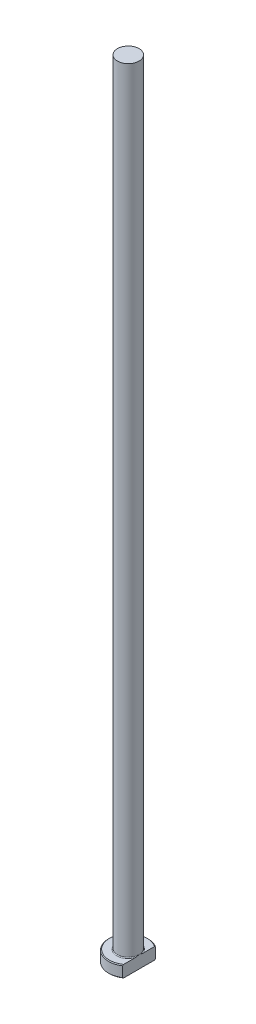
ISO-10303-21;
HEADER;
FILE_DESCRIPTION(('STEP AP214'),'2;1');
FILE_NAME('part.step','',(''),(''),'','','');
FILE_SCHEMA(('AUTOMOTIVE_DESIGN { 1 0 10303 214 1 1 1 1 }'));
ENDSEC;
DATA;
#1=APPLICATION_CONTEXT('core data for automotive mechanical design processes');
#2=APPLICATION_PROTOCOL_DEFINITION('international standard','automotive_design',2000,#1);
#3=PRODUCT_CONTEXT('',#1,'mechanical');
#4=PRODUCT('Part','Part','',(#3));
#5=PRODUCT_RELATED_PRODUCT_CATEGORY('part','',(#4));
#6=PRODUCT_DEFINITION_FORMATION('','',#4);
#7=PRODUCT_DEFINITION_CONTEXT('part definition',#1,'design');
#8=PRODUCT_DEFINITION('design','',#6,#7);
#9=PRODUCT_DEFINITION_SHAPE('','',#8);
#10=(LENGTH_UNIT() NAMED_UNIT(*) SI_UNIT(.MILLI.,.METRE.));
#11=(NAMED_UNIT(*) PLANE_ANGLE_UNIT() SI_UNIT($,.RADIAN.));
#12=(NAMED_UNIT(*) SI_UNIT($,.STERADIAN.) SOLID_ANGLE_UNIT());
#13=UNCERTAINTY_MEASURE_WITH_UNIT(LENGTH_MEASURE(1.E-05),#10,'distance_accuracy_value','');
#14=(GEOMETRIC_REPRESENTATION_CONTEXT(3) GLOBAL_UNCERTAINTY_ASSIGNED_CONTEXT((#13)) GLOBAL_UNIT_ASSIGNED_CONTEXT((#10,
#11,#12)) REPRESENTATION_CONTEXT('',''));
#15=CARTESIAN_POINT('',(0.,0.,0.));
#16=DIRECTION('',(0.,0.,1.));
#17=DIRECTION('',(1.,0.,0.));
#18=AXIS2_PLACEMENT_3D('',#15,#16,#17);
#19=CARTESIAN_POINT('',(0.,0.,0.));
#20=DIRECTION('',(0.,-1.,0.));
#21=DIRECTION('',(0.,0.,-1.));
#22=AXIS2_PLACEMENT_3D('',#19,#20,#21);
#23=PLANE('',#22);
#24=CARTESIAN_POINT('',(0.,0.,0.));
#25=DIRECTION('',(0.,-1.,0.));
#26=DIRECTION('',(0.,0.,-1.));
#27=AXIS2_PLACEMENT_3D('',#24,#25,#26);
#28=CIRCLE('',#27,4.79999999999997);
#29=CARTESIAN_POINT('',(2.74999999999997,0.,3.93414539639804));
#30=VERTEX_POINT('',#29);
#31=CARTESIAN_POINT('',(2.74999999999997,0.,-3.93414539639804));
#32=VERTEX_POINT('',#31);
#33=EDGE_CURVE('E98',#30,#32,#28,.T.);
#34=ORIENTED_EDGE('',*,*,#33,.T.);
#35=DIRECTION('',(0.,0.,1.));
#36=VECTOR('',#35,1.);
#37=CARTESIAN_POINT('',(2.74999999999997,0.,-4.1758232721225));
#38=LINE('',#37,#36);
#39=EDGE_CURVE('E83',#32,#30,#38,.T.);
#40=ORIENTED_EDGE('',*,*,#39,.T.);
#41=EDGE_LOOP('',(#34,#40));
#42=FACE_BOUND('',#41,.T.);
#43=ADVANCED_FACE('F32',(#42),#23,.T.);
#44=CARTESIAN_POINT('',(0.,259.958771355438,0.));
#45=DIRECTION('',(0.,1.,0.));
#46=DIRECTION('',(0.,0.,1.));
#47=AXIS2_PLACEMENT_3D('',#44,#45,#46);
#48=CYLINDRICAL_SURFACE('',#47,4.99999999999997);
#49=CARTESIAN_POINT('',(0.,2.79999999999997,0.));
#50=DIRECTION('',(0.,1.,0.));
#51=DIRECTION('',(0.,0.,1.));
#52=AXIS2_PLACEMENT_3D('',#49,#50,#51);
#53=CIRCLE('',#52,4.99999999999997);
#54=CARTESIAN_POINT('',(2.74999999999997,2.79999999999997,4.1758232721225));
#55=VERTEX_POINT('',#54);
#56=CARTESIAN_POINT('',(2.74999999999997,2.79999999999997,-4.1758232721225));
#57=VERTEX_POINT('',#56);
#58=EDGE_CURVE('E104',#55,#57,#53,.F.);
#59=ORIENTED_EDGE('',*,*,#58,.T.);
#60=DIRECTION('',(0.,-1.,0.));
#61=VECTOR('',#60,1.);
#62=CARTESIAN_POINT('',(2.74999999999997,200.,-4.1758232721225));
#63=LINE('',#62,#61);
#64=CARTESIAN_POINT('',(2.74999999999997,0.200000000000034,-4.1758232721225));
#65=VERTEX_POINT('',#64);
#66=EDGE_CURVE('E183',#57,#65,#63,.T.);
#67=ORIENTED_EDGE('',*,*,#66,.T.);
#68=CARTESIAN_POINT('',(0.,0.200000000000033,0.));
#69=DIRECTION('',(0.,-1.,0.));
#70=DIRECTION('',(0.,0.,-1.));
#71=AXIS2_PLACEMENT_3D('',#68,#69,#70);
#72=CIRCLE('',#71,4.99999999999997);
#73=CARTESIAN_POINT('',(2.74999999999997,0.200000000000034,4.1758232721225));
#74=VERTEX_POINT('',#73);
#75=EDGE_CURVE('E100',#65,#74,#72,.F.);
#76=ORIENTED_EDGE('',*,*,#75,.T.);
#77=DIRECTION('',(0.,-1.,0.));
#78=VECTOR('',#77,1.);
#79=CARTESIAN_POINT('',(2.74999999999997,200.,4.1758232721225));
#80=LINE('',#79,#78);
#81=EDGE_CURVE('E93',#55,#74,#80,.T.);
#82=ORIENTED_EDGE('',*,*,#81,.F.);
#83=EDGE_LOOP('',(#59,#67,#76,#82));
#84=FACE_BOUND('',#83,.T.);
#85=ADVANCED_FACE('F158',(#84),#48,.T.);
#86=CARTESIAN_POINT('',(-4.99999999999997,3.,0.));
#87=DIRECTION('',(0.,1.,0.));
#88=DIRECTION('',(0.,0.,1.));
#89=AXIS2_PLACEMENT_3D('',#86,#87,#88);
#90=PLANE('',#89);
#91=CARTESIAN_POINT('',(0.,3.,0.));
#92=DIRECTION('',(0.,1.,0.));
#93=DIRECTION('',(0.,0.,1.));
#94=AXIS2_PLACEMENT_3D('',#91,#92,#93);
#95=CIRCLE('',#94,4.79999999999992);
#96=CARTESIAN_POINT('',(2.74999999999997,3.,-3.93414539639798));
#97=VERTEX_POINT('',#96);
#98=CARTESIAN_POINT('',(2.74999999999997,3.,3.93414539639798));
#99=VERTEX_POINT('',#98);
#100=EDGE_CURVE('E178',#97,#99,#95,.T.);
#101=ORIENTED_EDGE('',*,*,#100,.T.);
#102=DIRECTION('',(0.,0.,-1.));
#103=VECTOR('',#102,1.);
#104=CARTESIAN_POINT('',(2.74999999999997,3.,0.));
#105=LINE('',#104,#103);
#106=CARTESIAN_POINT('',(2.74999999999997,2.99999999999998,1.06770782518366));
#107=VERTEX_POINT('',#106);
#108=EDGE_CURVE('E57',#99,#107,#105,.T.);
#109=ORIENTED_EDGE('',*,*,#108,.T.);
#110=CARTESIAN_POINT('',(0.,3.,0.));
#111=DIRECTION('',(0.,1.,0.));
#112=DIRECTION('',(0.,0.,1.));
#113=AXIS2_PLACEMENT_3D('',#110,#111,#112);
#114=CIRCLE('',#113,2.94999999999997);
#115=CARTESIAN_POINT('',(2.74999999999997,2.99999999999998,-1.06770782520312));
#116=VERTEX_POINT('',#115);
#117=EDGE_CURVE('E107',#107,#116,#114,.F.);
#118=ORIENTED_EDGE('',*,*,#117,.T.);
#119=EDGE_CURVE('E136',#116,#97,#105,.T.);
#120=ORIENTED_EDGE('',*,*,#119,.T.);
#121=EDGE_LOOP('',(#101,#109,#118,#120));
#122=FACE_BOUND('',#121,.T.);
#123=ADVANCED_FACE('F147',(#122),#90,.T.);
#124=CARTESIAN_POINT('',(0.,3.,0.));
#125=DIRECTION('',(0.,-1.,0.));
#126=DIRECTION('',(0.,0.,-1.));
#127=AXIS2_PLACEMENT_3D('',#124,#125,#126);
#128=CONICAL_SURFACE('',#127,4.79999999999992,0.785398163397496);
#129=ORIENTED_EDGE('',*,*,#58,.F.);
#130=CARTESIAN_POINT('',(2.74999999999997,-1.79114558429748,9.18844783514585));
#131=CARTESIAN_POINT('',(2.74999999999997,-1.62476324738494,9.0147689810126));
#132=CARTESIAN_POINT('',(2.74999999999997,-1.45857819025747,8.84090089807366));
#133=CARTESIAN_POINT('',(2.74999999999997,-1.12668775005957,8.49270511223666));
#134=CARTESIAN_POINT('',(2.74999999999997,-0.960982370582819,8.31837740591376));
#135=CARTESIAN_POINT('',(2.74999999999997,-0.464632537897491,7.79449769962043));
#136=CARTESIAN_POINT('',(2.74999999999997,-0.134839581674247,7.44413786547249));
#137=CARTESIAN_POINT('',(2.74999999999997,0.521406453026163,6.74030951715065));
#138=CARTESIAN_POINT('',(2.74999999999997,0.847859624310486,6.38684108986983));
#139=CARTESIAN_POINT('',(2.74999999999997,1.33353933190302,5.85303151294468));
#140=CARTESIAN_POINT('',(2.74999999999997,1.49475728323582,5.67450358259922));
#141=CARTESIAN_POINT('',(2.74999999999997,1.81545552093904,5.31589537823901));
#142=CARTESIAN_POINT('',(2.74999999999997,1.97493583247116,5.1358151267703));
#143=CARTESIAN_POINT('',(2.74999999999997,2.28246157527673,4.78409714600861));
#144=CARTESIAN_POINT('',(2.74999999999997,2.43063567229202,4.61257212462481));
#145=CARTESIAN_POINT('',(2.74999999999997,2.72427023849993,4.26717959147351));
#146=CARTESIAN_POINT('',(2.74999999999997,2.86973045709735,4.09331186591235));
#147=CARTESIAN_POINT('',(2.74999999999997,3.15716227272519,3.74214491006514));
#148=CARTESIAN_POINT('',(2.74999999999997,3.29912659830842,3.56483970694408));
#149=CARTESIAN_POINT('',(2.74999999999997,3.57763983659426,3.20603939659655));
#150=CARTESIAN_POINT('',(2.74999999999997,3.71418980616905,3.02454511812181));
#151=CARTESIAN_POINT('',(2.74999999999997,3.93857405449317,2.71219163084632));
#152=CARTESIAN_POINT('',(2.74999999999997,4.02851673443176,2.58285434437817));
#153=CARTESIAN_POINT('',(2.74999999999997,4.20308451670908,2.32054245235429));
#154=CARTESIAN_POINT('',(2.74999999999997,4.28770764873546,2.18756652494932));
#155=CARTESIAN_POINT('',(2.74999999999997,4.4493195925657,1.9173567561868));
#156=CARTESIAN_POINT('',(2.74999999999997,4.52632375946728,1.78013224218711));
#157=CARTESIAN_POINT('',(2.74999999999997,4.66966790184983,1.50031327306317));
#158=CARTESIAN_POINT('',(2.74999999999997,4.73601725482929,1.35772367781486));
#159=CARTESIAN_POINT('',(2.74999999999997,4.86065113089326,1.04856386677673));
#160=CARTESIAN_POINT('',(2.74999999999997,4.9170079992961,0.881171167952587));
#161=CARTESIAN_POINT('',(2.74999999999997,4.98102802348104,0.625229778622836));
#162=CARTESIAN_POINT('',(2.74999999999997,4.99893817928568,0.539229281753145));
#163=CARTESIAN_POINT('',(2.74999999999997,5.02707157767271,0.365959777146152));
#164=CARTESIAN_POINT('',(2.74999999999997,5.03729562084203,0.2786909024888));
#165=CARTESIAN_POINT('',(2.74999999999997,5.04949232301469,0.102763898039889));
#166=CARTESIAN_POINT('',(2.74999999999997,5.05138838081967,0.0141003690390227));
#167=CARTESIAN_POINT('',(2.74999999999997,5.04659669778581,-0.162990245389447));
#168=CARTESIAN_POINT('',(2.74999999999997,5.03990892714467,-0.251417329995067));
#169=CARTESIAN_POINT('',(2.74999999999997,5.01835539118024,-0.427430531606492));
#170=CARTESIAN_POINT('',(2.74999999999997,5.00347341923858,-0.515014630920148));
#171=CARTESIAN_POINT('',(2.74999999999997,4.9663672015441,-0.688602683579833));
#172=CARTESIAN_POINT('',(2.74999999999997,4.94414138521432,-0.774606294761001));
#173=CARTESIAN_POINT('',(2.74999999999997,4.88037969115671,-0.988315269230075));
#174=CARTESIAN_POINT('',(2.74999999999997,4.83478497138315,-1.11480587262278));
#175=CARTESIAN_POINT('',(2.74999999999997,4.7327190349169,-1.36329985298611));
#176=CARTESIAN_POINT('',(2.74999999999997,4.67623944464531,-1.48529968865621));
#177=CARTESIAN_POINT('',(2.74999999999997,4.5549822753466,-1.72582737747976));
#178=CARTESIAN_POINT('',(2.74999999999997,4.4901643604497,-1.8443346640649));
#179=CARTESIAN_POINT('',(2.74999999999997,4.38849038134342,-2.01944141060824));
#180=CARTESIAN_POINT('',(2.74999999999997,4.3538638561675,-2.07735876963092));
#181=CARTESIAN_POINT('',(2.74999999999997,4.28331846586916,-2.19239883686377));
#182=CARTESIAN_POINT('',(2.74999999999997,4.24739965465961,-2.24952157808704));
#183=CARTESIAN_POINT('',(2.74999999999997,4.12488368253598,-2.44019263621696));
#184=CARTESIAN_POINT('',(2.74999999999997,4.03574833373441,-2.57211125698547));
#185=CARTESIAN_POINT('',(2.74999999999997,3.8530043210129,-2.83282496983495));
#186=CARTESIAN_POINT('',(2.74999999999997,3.75939460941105,-2.96161931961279));
#187=CARTESIAN_POINT('',(2.74999999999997,3.56878484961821,-3.21681212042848));
#188=CARTESIAN_POINT('',(2.74999999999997,3.47178237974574,-3.34320875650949));
#189=CARTESIAN_POINT('',(2.74999999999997,3.27524323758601,-3.59402090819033));
#190=CARTESIAN_POINT('',(2.74999999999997,3.17570641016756,-3.7184363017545));
#191=CARTESIAN_POINT('',(2.74999999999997,2.97442282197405,-3.96596722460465));
#192=CARTESIAN_POINT('',(2.74999999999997,2.87267126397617,-4.08907884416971));
#193=CARTESIAN_POINT('',(2.74999999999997,2.66760125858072,-4.33399167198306));
#194=CARTESIAN_POINT('',(2.74999999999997,2.56428277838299,-4.45579285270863));
#195=CARTESIAN_POINT('',(2.74999999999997,2.25255029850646,-4.81947940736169));
#196=CARTESIAN_POINT('',(2.74999999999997,2.04226620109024,-5.05976099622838));
#197=CARTESIAN_POINT('',(2.74999999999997,1.61812846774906,-5.53760543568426));
#198=CARTESIAN_POINT('',(2.74999999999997,1.40427119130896,-5.77516503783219));
#199=CARTESIAN_POINT('',(2.74999999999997,0.974157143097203,-6.248143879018));
#200=CARTESIAN_POINT('',(2.74999999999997,0.757900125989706,-6.48356289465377));
#201=CARTESIAN_POINT('',(2.74999999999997,0.323911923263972,-6.95249982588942));
#202=CARTESIAN_POINT('',(2.74999999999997,0.106182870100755,-7.18601971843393));
#203=CARTESIAN_POINT('',(2.74999999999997,-0.330587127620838,-7.65182952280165));
#204=CARTESIAN_POINT('',(2.74999999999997,-0.549628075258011,-7.88411943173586));
#205=CARTESIAN_POINT('',(2.74999999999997,-0.854135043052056,-8.20563072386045));
#206=CARTESIAN_POINT('',(2.74999999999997,-0.939169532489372,-8.29526139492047));
#207=CARTESIAN_POINT('',(2.74999999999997,-1.10939110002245,-8.47440444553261));
#208=CARTESIAN_POINT('',(2.74999999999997,-1.1945781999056,-8.56391680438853));
#209=CARTESIAN_POINT('',(2.74999999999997,-1.36493542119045,-8.74266965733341));
#210=CARTESIAN_POINT('',(2.74999999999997,-1.45010532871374,-8.83191035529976));
#211=CARTESIAN_POINT('',(2.74999999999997,-1.62054776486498,-9.01026683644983));
#212=CARTESIAN_POINT('',(2.74999999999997,-1.7058202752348,-9.09938263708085));
#213=CARTESIAN_POINT('',(2.74999999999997,-1.79114558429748,-9.18844783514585));
#214=B_SPLINE_CURVE_WITH_KNOTS('',3,(#130,#131,#132,#133,#134,#135,#136,#137,#138,#139,#140,
#141,#142,#143,#144,#145,#146,#147,#148,#149,#150,#151,#152,#153,#154,#155,#156,#157,#158,#159,
#160,#161,#162,#163,#164,#165,#166,#167,#168,#169,#170,#171,#172,#173,#174,#175,#176,#177,#178,
#179,#180,#181,#182,#183,#184,#185,#186,#187,#188,#189,#190,#191,#192,#193,#194,#195,#196,#197,
#198,#199,#200,#201,#202,#203,#204,#205,#206,#207,#208,#209,#210,#211,#212,#213),.UNSPECIFIED.,
.F.,.F.,(4,2,2,2,2,2,2,2,2,2,2,2,2,2,2,2,2,2,2,2,2,2,2,2,2,2,2,2,2,2,2,2,2,2,2,2,2,2,2,2,2,4),
(0.,0.721544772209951,1.44309493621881,2.88656432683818,4.32999349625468,5.05163004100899,
5.77325612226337,6.45322671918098,7.13325979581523,7.81460476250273,8.49581607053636,
8.96833065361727,9.4410192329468,9.91273488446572,10.3840330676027,10.9119743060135,
11.1752192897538,11.4384368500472,11.7040704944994,11.9697050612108,12.2358669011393,
12.5020857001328,12.9047274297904,13.3076801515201,13.712661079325,13.9150857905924,
14.1175020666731,14.5949844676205,15.0725792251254,15.5505221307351,16.0284943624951,
16.5076321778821,16.9867800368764,17.9446362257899,18.9035363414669,19.862535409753,
20.8203587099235,21.7781842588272,22.1488332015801,22.5195401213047,22.889621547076,
23.259644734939),.UNSPECIFIED.);
#215=EDGE_CURVE('E135',#55,#99,#214,.T.);
#216=ORIENTED_EDGE('',*,*,#215,.T.);
#217=ORIENTED_EDGE('',*,*,#100,.F.);
#218=EDGE_CURVE('E127',#97,#57,#214,.T.);
#219=ORIENTED_EDGE('',*,*,#218,.T.);
#220=EDGE_LOOP('',(#129,#216,#217,#219));
#221=FACE_BOUND('',#220,.T.);
#222=ADVANCED_FACE('F143',(#221),#128,.T.);
#223=CARTESIAN_POINT('',(0.,0.200000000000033,0.));
#224=DIRECTION('',(0.,1.,0.));
#225=DIRECTION('',(0.,0.,1.));
#226=AXIS2_PLACEMENT_3D('',#223,#224,#225);
#227=CONICAL_SURFACE('',#226,4.99999999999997,0.785398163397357);
#228=ORIENTED_EDGE('',*,*,#75,.F.);
#229=CARTESIAN_POINT('',(2.74999999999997,4.79114558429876,-9.18844783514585));
#230=CARTESIAN_POINT('',(2.74999999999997,4.62476324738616,-9.01476898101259));
#231=CARTESIAN_POINT('',(2.74999999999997,4.45857819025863,-8.84090089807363));
#232=CARTESIAN_POINT('',(2.74999999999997,4.12668775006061,-8.49270511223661));
#233=CARTESIAN_POINT('',(2.74999999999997,3.9609823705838,-8.3183774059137));
#234=CARTESIAN_POINT('',(2.74999999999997,3.4646325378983,-7.79449769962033));
#235=CARTESIAN_POINT('',(2.74999999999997,3.13483958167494,-7.44413786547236));
#236=CARTESIAN_POINT('',(2.74999999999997,2.47859354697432,-6.74030951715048));
#237=CARTESIAN_POINT('',(2.74999999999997,2.15214037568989,-6.38684108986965));
#238=CARTESIAN_POINT('',(2.74999999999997,1.6664606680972,-5.85303151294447));
#239=CARTESIAN_POINT('',(2.74999999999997,1.50524271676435,-5.674503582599));
#240=CARTESIAN_POINT('',(2.74999999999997,1.18454447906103,-5.31589537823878));
#241=CARTESIAN_POINT('',(2.74999999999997,1.02506416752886,-5.13581512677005));
#242=CARTESIAN_POINT('',(2.74999999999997,0.717538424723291,-4.78409714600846));
#243=CARTESIAN_POINT('',(2.74999999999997,0.569364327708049,-4.61257212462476));
#244=CARTESIAN_POINT('',(2.74999999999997,0.275729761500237,-4.26717959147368));
#245=CARTESIAN_POINT('',(2.74999999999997,0.130269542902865,-4.09331186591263));
#246=CARTESIAN_POINT('',(2.74999999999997,-0.157162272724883,-3.74214491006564));
#247=CARTESIAN_POINT('',(2.74999999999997,-0.299126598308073,-3.56483970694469));
#248=CARTESIAN_POINT('',(2.74999999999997,-0.577639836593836,-3.20603939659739));
#249=CARTESIAN_POINT('',(2.74999999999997,-0.714189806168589,-3.02454511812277));
#250=CARTESIAN_POINT('',(2.74999999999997,-0.938574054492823,-2.71219163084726));
#251=CARTESIAN_POINT('',(2.74999999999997,-1.02851673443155,-2.58285434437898));
#252=CARTESIAN_POINT('',(2.74999999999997,-1.20308451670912,-2.32054245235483));
#253=CARTESIAN_POINT('',(2.74999999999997,-1.28770764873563,-2.18756652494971));
#254=CARTESIAN_POINT('',(2.74999999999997,-1.4493195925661,-1.91735675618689));
#255=CARTESIAN_POINT('',(2.74999999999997,-1.52632375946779,-1.78013224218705));
#256=CARTESIAN_POINT('',(2.74999999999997,-1.66966790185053,-1.5003132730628));
#257=CARTESIAN_POINT('',(2.74999999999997,-1.73601725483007,-1.35772367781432));
#258=CARTESIAN_POINT('',(2.74999999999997,-1.86065113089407,-1.04856386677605));
#259=CARTESIAN_POINT('',(2.74999999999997,-1.91700799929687,-0.881171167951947));
#260=CARTESIAN_POINT('',(2.74999999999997,-1.98102802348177,-0.625229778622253));
#261=CARTESIAN_POINT('',(2.74999999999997,-1.99893817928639,-0.53922928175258));
#262=CARTESIAN_POINT('',(2.74999999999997,-2.0270715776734,-0.365959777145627));
#263=CARTESIAN_POINT('',(2.74999999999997,-2.0372956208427,-0.278690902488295));
#264=CARTESIAN_POINT('',(2.74999999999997,-2.04949232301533,-0.102763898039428));
#265=CARTESIAN_POINT('',(2.74999999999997,-2.05138838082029,-0.0141003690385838));
#266=CARTESIAN_POINT('',(2.74999999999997,-2.04659669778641,0.162990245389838));
#267=CARTESIAN_POINT('',(2.74999999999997,-2.03990892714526,0.251417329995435));
#268=CARTESIAN_POINT('',(2.74999999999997,-2.0183553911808,0.42743053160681));
#269=CARTESIAN_POINT('',(2.74999999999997,-2.00347341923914,0.515014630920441));
#270=CARTESIAN_POINT('',(2.74999999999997,-1.96636720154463,0.688602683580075));
#271=CARTESIAN_POINT('',(2.74999999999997,-1.94414138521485,0.774606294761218));
#272=CARTESIAN_POINT('',(2.74999999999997,-1.88037969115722,0.988315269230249));
#273=CARTESIAN_POINT('',(2.74999999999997,-1.83478497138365,1.11480587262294));
#274=CARTESIAN_POINT('',(2.74999999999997,-1.73271903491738,1.36329985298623));
#275=CARTESIAN_POINT('',(2.74999999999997,-1.67623944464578,1.48529968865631));
#276=CARTESIAN_POINT('',(2.74999999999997,-1.55498227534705,1.72582737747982));
#277=CARTESIAN_POINT('',(2.74999999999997,-1.49016436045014,1.84433466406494));
#278=CARTESIAN_POINT('',(2.74999999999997,-1.38849038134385,2.01944141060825));
#279=CARTESIAN_POINT('',(2.74999999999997,-1.35386385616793,2.07735876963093));
#280=CARTESIAN_POINT('',(2.74999999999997,-1.28331846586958,2.19239883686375));
#281=CARTESIAN_POINT('',(2.74999999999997,-1.24739965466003,2.24952157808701));
#282=CARTESIAN_POINT('',(2.74999999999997,-1.12488368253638,2.4401926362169));
#283=CARTESIAN_POINT('',(2.74999999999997,-1.0357483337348,2.57211125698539));
#284=CARTESIAN_POINT('',(2.74999999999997,-0.853004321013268,2.83282496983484));
#285=CARTESIAN_POINT('',(2.74999999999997,-0.759394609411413,2.96161931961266));
#286=CARTESIAN_POINT('',(2.74999999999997,-0.568784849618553,3.21681212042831));
#287=CARTESIAN_POINT('',(2.74999999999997,-0.471782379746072,3.34320875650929));
#288=CARTESIAN_POINT('',(2.74999999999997,-0.275243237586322,3.5940209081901));
#289=CARTESIAN_POINT('',(2.74999999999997,-0.175706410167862,3.71843630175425));
#290=CARTESIAN_POINT('',(2.74999999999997,0.025577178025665,3.96596722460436));
#291=CARTESIAN_POINT('',(2.74999999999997,0.127328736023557,4.0890788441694));
#292=CARTESIAN_POINT('',(2.74999999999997,0.332398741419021,4.33399167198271));
#293=CARTESIAN_POINT('',(2.74999999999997,0.43571722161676,4.45579285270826));
#294=CARTESIAN_POINT('',(2.74999999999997,0.747449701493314,4.81947940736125));
#295=CARTESIAN_POINT('',(2.74999999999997,0.957733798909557,5.0597609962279));
#296=CARTESIAN_POINT('',(2.74999999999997,1.38187153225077,5.5376054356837));
#297=CARTESIAN_POINT('',(2.74999999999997,1.59572880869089,5.77516503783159));
#298=CARTESIAN_POINT('',(2.74999999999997,2.02584285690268,6.24814387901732));
#299=CARTESIAN_POINT('',(2.74999999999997,2.2420998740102,6.48356289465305));
#300=CARTESIAN_POINT('',(2.74999999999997,2.67608807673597,6.95249982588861));
#301=CARTESIAN_POINT('',(2.74999999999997,2.8938171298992,7.18601971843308));
#302=CARTESIAN_POINT('',(2.74999999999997,3.33058712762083,7.65182952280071));
#303=CARTESIAN_POINT('',(2.74999999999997,3.54962807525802,7.88411943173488));
#304=CARTESIAN_POINT('',(2.74999999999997,3.85413504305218,8.20563072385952));
#305=CARTESIAN_POINT('',(2.74999999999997,3.9391695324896,8.29526139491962));
#306=CARTESIAN_POINT('',(2.74999999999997,4.10939110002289,8.47440444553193));
#307=CARTESIAN_POINT('',(2.74999999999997,4.19457819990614,8.56391680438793));
#308=CARTESIAN_POINT('',(2.74999999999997,4.3649354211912,8.74266965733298));
#309=CARTESIAN_POINT('',(2.74999999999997,4.4501053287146,8.83191035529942));
#310=CARTESIAN_POINT('',(2.74999999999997,4.62054776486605,9.01026683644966));
#311=CARTESIAN_POINT('',(2.74999999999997,4.70582027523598,9.09938263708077));
#312=CARTESIAN_POINT('',(2.74999999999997,4.79114558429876,9.18844783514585));
#313=B_SPLINE_CURVE_WITH_KNOTS('',3,(#229,#230,#231,#232,#233,#234,#235,#236,#237,#238,#239,
#240,#241,#242,#243,#244,#245,#246,#247,#248,#249,#250,#251,#252,#253,#254,#255,#256,#257,#258,
#259,#260,#261,#262,#263,#264,#265,#266,#267,#268,#269,#270,#271,#272,#273,#274,#275,#276,#277,
#278,#279,#280,#281,#282,#283,#284,#285,#286,#287,#288,#289,#290,#291,#292,#293,#294,#295,#296,
#297,#298,#299,#300,#301,#302,#303,#304,#305,#306,#307,#308,#309,#310,#311,#312),.UNSPECIFIED.,
.F.,.F.,(4,2,2,2,2,2,2,2,2,2,2,2,2,2,2,2,2,2,2,2,2,2,2,2,2,2,2,2,2,2,2,2,2,2,2,2,2,2,2,2,2,4),
(0.,0.721544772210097,1.4430949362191,2.88656432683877,4.32999349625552,5.05163004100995,
5.77325612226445,6.45322671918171,7.13325979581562,7.81460476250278,8.49581607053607,
8.96833065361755,9.44101923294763,9.91273488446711,10.3840330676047,10.9119743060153,
11.1752192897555,11.4384368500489,11.704070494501,11.9697050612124,12.2358669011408,
12.5020857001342,12.9047274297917,13.3076801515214,13.7126610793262,13.9150857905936,
14.1175020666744,14.5949844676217,15.0725792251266,15.5505221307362,16.0284943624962,
16.5076321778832,16.9867800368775,17.9446362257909,18.9035363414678,19.8625354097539,
20.8203587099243,21.778184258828,22.1488332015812,22.5195401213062,22.889621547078,
23.2596447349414),.UNSPECIFIED.);
#314=EDGE_CURVE('E86',#65,#32,#313,.T.);
#315=ORIENTED_EDGE('',*,*,#314,.T.);
#316=ORIENTED_EDGE('',*,*,#33,.F.);
#317=EDGE_CURVE('E89',#30,#74,#313,.T.);
#318=ORIENTED_EDGE('',*,*,#317,.T.);
#319=EDGE_LOOP('',(#228,#315,#316,#318));
#320=FACE_BOUND('',#319,.T.);
#321=ADVANCED_FACE('F97',(#320),#227,.T.);
#322=CARTESIAN_POINT('',(0.,3.19999999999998,0.));
#323=DIRECTION('',(0.,1.,0.));
#324=DIRECTION('',(0.,0.,1.));
#325=AXIS2_PLACEMENT_3D('',#322,#323,#324);
#326=TOROIDAL_SURFACE('',#325,2.94999999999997,0.2);
#327=CARTESIAN_POINT('',(2.74999999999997,3.19999999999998,0.));
#328=CARTESIAN_POINT('',(2.74999999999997,3.20000050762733,1.12997179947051E-10));
#329=CARTESIAN_POINT('',(2.74999999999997,3.20000101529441,-1.81527532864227E-07));
#330=CARTESIAN_POINT('',(2.74999999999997,3.20000196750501,-6.94840309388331E-07));
#331=CARTESIAN_POINT('',(2.74999999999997,3.20000240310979,-1.03787717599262E-06));
#332=CARTESIAN_POINT('',(2.74999999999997,3.20000330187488,-1.85808127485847E-06));
#333=CARTESIAN_POINT('',(2.74999999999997,3.20000375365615,-2.34835981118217E-06));
#334=CARTESIAN_POINT('',(2.74999999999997,3.20000456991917,-3.3704695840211E-06));
#335=CARTESIAN_POINT('',(2.74999999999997,3.20000493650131,-3.90074158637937E-06));
#336=CARTESIAN_POINT('',(2.74999999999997,3.20000627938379,-5.9326172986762E-06));
#337=CARTESIAN_POINT('',(2.74999999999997,3.20000718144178,-7.48563172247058E-06));
#338=CARTESIAN_POINT('',(2.74999999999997,3.20000868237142,-1.0579008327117E-05));
#339=CARTESIAN_POINT('',(2.74999999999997,3.20000929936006,-1.21109700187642E-05));
#340=CARTESIAN_POINT('',(2.74999999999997,3.2000118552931,-1.85322192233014E-05));
#341=CARTESIAN_POINT('',(2.74999999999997,3.20001373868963,-2.34472711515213E-05));
#342=CARTESIAN_POINT('',(2.74999999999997,3.20001654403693,-3.27779451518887E-05));
#343=CARTESIAN_POINT('',(2.74999999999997,3.20001756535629,-3.71636222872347E-05));
#344=CARTESIAN_POINT('',(2.74999999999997,3.20002495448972,-6.95743732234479E-05));
#345=CARTESIAN_POINT('',(2.74999999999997,3.20003050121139,-9.77394523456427E-05));
#346=CARTESIAN_POINT('',(2.74999999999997,3.20005478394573,-0.000208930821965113));
#347=CARTESIAN_POINT('',(2.74999999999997,3.2000780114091,-0.000290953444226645));
#348=CARTESIAN_POINT('',(2.74999999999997,3.20016837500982,-0.000615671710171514));
#349=CARTESIAN_POINT('',(2.74999999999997,3.20023256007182,-0.0008589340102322));
#350=CARTESIAN_POINT('',(2.74999999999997,3.20048946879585,-0.00182516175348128));
#351=CARTESIAN_POINT('',(2.74999999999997,3.20068588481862,-0.00254739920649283));
#352=CARTESIAN_POINT('',(2.74999999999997,3.20150145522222,-0.0055546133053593));
#353=CARTESIAN_POINT('',(2.74999999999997,3.20211597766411,-0.00784050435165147));
#354=CARTESIAN_POINT('',(2.74999999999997,3.20754641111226,-0.0280301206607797));
#355=CARTESIAN_POINT('',(2.74999999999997,3.2123805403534,-0.0459303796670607));
#356=CARTESIAN_POINT('',(2.74999999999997,3.22182435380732,-0.081029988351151));
#357=CARTESIAN_POINT('',(2.74999999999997,3.226435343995,-0.0982290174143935));
#358=CARTESIAN_POINT('',(2.74999999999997,3.23620184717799,-0.134808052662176));
#359=CARTESIAN_POINT('',(2.74999999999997,3.24135263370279,-0.154189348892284));
#360=CARTESIAN_POINT('',(2.74999999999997,3.25163624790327,-0.193181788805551));
#361=CARTESIAN_POINT('',(2.74999999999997,3.25676827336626,-0.21279314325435));
#362=CARTESIAN_POINT('',(2.74999999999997,3.26905119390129,-0.260223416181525));
#363=CARTESIAN_POINT('',(2.74999999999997,3.27615177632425,-0.288055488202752));
#364=CARTESIAN_POINT('',(2.74999999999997,3.28988618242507,-0.343037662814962));
#365=CARTESIAN_POINT('',(2.74999999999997,3.29652742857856,-0.370185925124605));
#366=CARTESIAN_POINT('',(2.74999999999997,3.3179119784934,-0.460013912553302));
#367=CARTESIAN_POINT('',(2.74999999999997,3.33192996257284,-0.522872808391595));
#368=CARTESIAN_POINT('',(2.74999999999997,3.35724782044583,-0.649858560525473));
#369=CARTESIAN_POINT('',(2.74999999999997,3.36851625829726,-0.713991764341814));
#370=CARTESIAN_POINT('',(2.74999999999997,3.38744836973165,-0.848144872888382));
#371=CARTESIAN_POINT('',(2.74999999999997,3.39474814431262,-0.918222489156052));
#372=CARTESIAN_POINT('',(2.74999999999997,3.39971832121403,-1.02344881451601));
#373=CARTESIAN_POINT('',(2.74999999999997,3.40038441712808,-1.05845158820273));
#374=CARTESIAN_POINT('',(2.74999999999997,3.39917295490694,-1.12840448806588));
#375=CARTESIAN_POINT('',(2.74999999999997,3.39729798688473,-1.16335463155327));
#376=CARTESIAN_POINT('',(2.74999999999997,3.39199994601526,-1.21505383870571));
#377=CARTESIAN_POINT('',(2.74999999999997,3.38986571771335,-1.23193598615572));
#378=CARTESIAN_POINT('',(2.74999999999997,3.38464996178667,-1.26557152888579));
#379=CARTESIAN_POINT('',(2.74999999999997,3.38156766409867,-1.28232480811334));
#380=CARTESIAN_POINT('',(2.74999999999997,3.37431364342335,-1.31540767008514));
#381=CARTESIAN_POINT('',(2.74999999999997,3.37015411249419,-1.33173987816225));
#382=CARTESIAN_POINT('',(2.74999999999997,3.36048976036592,-1.36399299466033));
#383=CARTESIAN_POINT('',(2.74999999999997,3.35498646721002,-1.37991434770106));
#384=CARTESIAN_POINT('',(2.74999999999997,3.34222746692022,-1.41123903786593));
#385=CARTESIAN_POINT('',(2.74999999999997,3.33495457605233,-1.42663549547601));
#386=CARTESIAN_POINT('',(2.74999999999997,3.318175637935,-1.45617471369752));
#387=CARTESIAN_POINT('',(2.74999999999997,3.30867792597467,-1.4703218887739));
#388=CARTESIAN_POINT('',(2.74999999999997,3.29277007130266,-1.48907990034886));
#389=CARTESIAN_POINT('',(2.74999999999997,3.2875192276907,-1.49466894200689));
#390=CARTESIAN_POINT('',(2.74999999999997,3.27634440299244,-1.50515028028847));
#391=CARTESIAN_POINT('',(2.74999999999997,3.27042002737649,-1.51004216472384));
#392=CARTESIAN_POINT('',(2.74999999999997,3.25778482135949,-1.51891099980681));
#393=CARTESIAN_POINT('',(2.74999999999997,3.2510643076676,-1.52287446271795));
#394=CARTESIAN_POINT('',(2.74999999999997,3.23698143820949,-1.5294174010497));
#395=CARTESIAN_POINT('',(2.74999999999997,3.22962116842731,-1.53200119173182));
#396=CARTESIAN_POINT('',(2.74999999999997,3.2166326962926,-1.53496289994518));
#397=CARTESIAN_POINT('',(2.74999999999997,3.2110985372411,-1.53575651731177));
#398=CARTESIAN_POINT('',(2.74999999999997,3.19997558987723,-1.53638738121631));
#399=CARTESIAN_POINT('',(2.74999999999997,3.19438682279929,-1.53622498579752));
#400=CARTESIAN_POINT('',(2.74999999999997,3.18332943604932,-1.53495937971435));
#401=CARTESIAN_POINT('',(2.74999999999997,3.17786061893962,-1.53385785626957));
#402=CARTESIAN_POINT('',(2.74999999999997,3.16716525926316,-1.53080991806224));
#403=CARTESIAN_POINT('',(2.74999999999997,3.16193889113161,-1.52886290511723));
#404=CARTESIAN_POINT('',(2.74999999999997,3.14983366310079,-1.52335528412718));
#405=CARTESIAN_POINT('',(2.74999999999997,3.14310699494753,-1.51946144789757));
#406=CARTESIAN_POINT('',(2.74999999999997,3.13035821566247,-1.51065443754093));
#407=CARTESIAN_POINT('',(2.74999999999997,3.12433789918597,-1.50573875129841));
#408=CARTESIAN_POINT('',(2.74999999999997,3.10956608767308,-1.4920109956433));
#409=CARTESIAN_POINT('',(2.74999999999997,3.10134587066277,-1.48263193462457));
#410=CARTESIAN_POINT('',(2.74999999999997,3.08638427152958,-1.46278796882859));
#411=CARTESIAN_POINT('',(2.74999999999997,3.07964511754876,-1.45232146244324));
#412=CARTESIAN_POINT('',(2.74999999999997,3.06171675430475,-1.42080727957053));
#413=CARTESIAN_POINT('',(2.74999999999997,3.05211924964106,-1.39886385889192));
#414=CARTESIAN_POINT('',(2.74999999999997,3.03592584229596,-1.35377597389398));
#415=CARTESIAN_POINT('',(2.74999999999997,3.02935693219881,-1.33062268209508));
#416=CARTESIAN_POINT('',(2.74999999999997,3.01641276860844,-1.27469229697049));
#417=CARTESIAN_POINT('',(2.74999999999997,3.01110503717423,-1.24167224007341));
#418=CARTESIAN_POINT('',(2.74999999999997,3.00364182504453,-1.17522319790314));
#419=CARTESIAN_POINT('',(2.74999999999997,3.00149608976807,-1.14179326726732));
#420=CARTESIAN_POINT('',(2.74999999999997,2.99965905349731,-1.0761846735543));
#421=CARTESIAN_POINT('',(2.74999999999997,2.9998750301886,-1.04400821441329));
#422=CARTESIAN_POINT('',(2.74999999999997,3.00208041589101,-0.979705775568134));
#423=CARTESIAN_POINT('',(2.74999999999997,3.00407086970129,-0.94757983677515));
#424=CARTESIAN_POINT('',(2.74999999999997,3.01231998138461,-0.849711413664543));
#425=CARTESIAN_POINT('',(2.74999999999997,3.02086596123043,-0.784164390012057));
#426=CARTESIAN_POINT('',(2.74999999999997,3.04217753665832,-0.652153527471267));
#427=CARTESIAN_POINT('',(2.74999999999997,3.05504187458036,-0.585706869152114));
#428=CARTESIAN_POINT('',(2.74999999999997,3.07899589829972,-0.474257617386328));
#429=CARTESIAN_POINT('',(2.74999999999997,3.08936705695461,-0.429096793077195));
#430=CARTESIAN_POINT('',(2.74999999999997,3.11088695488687,-0.339494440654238));
#431=CARTESIAN_POINT('',(2.74999999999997,3.12202574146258,-0.295050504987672));
#432=CARTESIAN_POINT('',(2.74999999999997,3.14355229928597,-0.211341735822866));
#433=CARTESIAN_POINT('',(2.74999999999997,3.15388178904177,-0.17206169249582));
#434=CARTESIAN_POINT('',(2.74999999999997,3.17523671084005,-0.0918970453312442));
#435=CARTESIAN_POINT('',(2.74999999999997,3.18627305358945,-0.0510152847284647));
#436=CARTESIAN_POINT('',(2.74999999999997,3.19788514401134,-0.00783595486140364));
#437=CARTESIAN_POINT('',(2.74999999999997,3.19850096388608,-0.00554554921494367));
#438=CARTESIAN_POINT('',(2.74999999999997,3.19931683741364,-0.00253730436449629));
#439=CARTESIAN_POINT('',(2.74999999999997,3.19951229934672,-0.00181855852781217));
#440=CARTESIAN_POINT('',(2.74999999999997,3.19976804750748,-0.000856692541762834));
#441=CARTESIAN_POINT('',(2.74999999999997,3.19983200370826,-0.000614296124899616));
#442=CARTESIAN_POINT('',(2.74999999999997,3.19992209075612,-0.000290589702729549));
#443=CARTESIAN_POINT('',(2.74999999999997,3.19994527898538,-0.000208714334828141));
#444=CARTESIAN_POINT('',(2.74999999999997,3.19996952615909,-9.76928428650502E-05));
#445=CARTESIAN_POINT('',(2.74999999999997,3.19997506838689,-6.95486157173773E-05));
#446=CARTESIAN_POINT('',(2.74999999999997,3.19998244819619,-3.71590915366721E-05));
#447=CARTESIAN_POINT('',(2.74999999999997,3.1999834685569,-3.2774592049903E-05));
#448=CARTESIAN_POINT('',(2.74999999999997,3.19998627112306,-2.34463157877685E-05));
#449=CARTESIAN_POINT('',(2.74999999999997,3.19998815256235,-1.85324214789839E-05));
#450=CARTESIAN_POINT('',(2.74999999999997,3.19999070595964,-1.21123670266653E-05));
#451=CARTESIAN_POINT('',(2.74999999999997,3.19999132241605,-1.05804935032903E-05));
#452=CARTESIAN_POINT('',(2.74999999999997,3.1999928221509,-7.4872040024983E-06));
#453=CARTESIAN_POINT('',(2.74999999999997,3.19999372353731,-5.93417784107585E-06));
#454=CARTESIAN_POINT('',(2.74999999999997,3.19999506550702,-3.90218205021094E-06));
#455=CARTESIAN_POINT('',(2.74999999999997,3.19999543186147,-3.37184999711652E-06));
#456=CARTESIAN_POINT('',(2.74999999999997,3.19999624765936,-2.3495790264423E-06));
#457=CARTESIAN_POINT('',(2.74999999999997,3.1999966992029,-1.85919798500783E-06));
#458=CARTESIAN_POINT('',(2.74999999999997,3.19999759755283,-1.03875218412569E-06));
#459=CARTESIAN_POINT('',(2.74999999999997,3.19999803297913,-6.95584891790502E-07));
#460=CARTESIAN_POINT('',(2.74999999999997,3.19999898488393,-1.81944076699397E-07));
#461=CARTESIAN_POINT('',(2.74999999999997,3.1999994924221,-1.12986168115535E-10));
#462=CARTESIAN_POINT('',(2.74999999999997,3.19999999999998,0.));
#463=B_SPLINE_CURVE_WITH_KNOTS('',3,(#327,#328,#329,#330,#331,#332,#333,#334,#335,#336,#337,
#338,#339,#340,#341,#342,#343,#344,#345,#346,#347,#348,#349,#350,#351,#352,#353,#354,#355,#356,
#357,#358,#359,#360,#361,#362,#363,#364,#365,#366,#367,#368,#369,#370,#371,#372,#373,#374,#375,
#376,#377,#378,#379,#380,#381,#382,#383,#384,#385,#386,#387,#388,#389,#390,#391,#392,#393,#394,
#395,#396,#397,#398,#399,#400,#401,#402,#403,#404,#405,#406,#407,#408,#409,#410,#411,#412,#413,
#414,#415,#416,#417,#418,#419,#420,#421,#422,#423,#424,#425,#426,#427,#428,#429,#430,#431,#432,
#433,#434,#435,#436,#437,#438,#439,#440,#441,#442,#443,#444,#445,#446,#447,#448,#449,#450,#451,
#452,#453,#454,#455,#456,#457,#458,#459,#460,#461,#462),.UNSPECIFIED.,.T.,.F.,(4,2,2,2,2,2,2,2,
2,2,2,2,2,2,2,2,2,2,2,2,2,2,2,2,2,2,2,2,2,2,2,2,2,2,2,2,2,2,2,2,2,2,2,2,2,2,2,2,2,2,2,2,2,2,2,2,
2,2,2,2,2,2,2,2,2,2,2,4),(0.,1.53302763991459E-06,3.19538931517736E-06,5.18410400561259E-06,
7.11680710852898E-06,1.24843266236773E-05,1.74346122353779E-05,3.3195428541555E-05,
4.66876455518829E-05,0.000132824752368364,0.000388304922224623,0.00114333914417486,
0.0033884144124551,0.0104899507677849,0.0661127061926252,0.119532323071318,0.179694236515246,
0.240509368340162,0.326678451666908,0.410524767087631,0.603684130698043,0.798958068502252,
1.00997653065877,1.11494231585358,1.21980118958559,1.27083021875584,1.32190080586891,
1.37241688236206,1.42287578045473,1.4738457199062,1.52462767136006,1.54758745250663,
1.57056075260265,1.59384955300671,1.61706507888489,1.6337610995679,1.65045086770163,
1.66711071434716,1.68378236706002,1.70696786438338,1.73021104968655,1.76741395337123,
1.80467244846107,1.87612299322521,1.94819858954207,2.0482867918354,2.14868283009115,
2.24515187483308,2.34167775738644,2.53976637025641,2.74273377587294,2.88173187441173,
3.01918106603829,3.14102752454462,3.268058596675,3.27517420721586,3.27740842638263,
3.27816077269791,3.27841579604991,3.27850186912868,3.27851535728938,3.27853111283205,
3.27853606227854,3.27854142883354,3.27854336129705,3.27854534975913,3.27854701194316,
3.2785485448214),.UNSPECIFIED.);
#464=CARTESIAN_POINT('',(2.74999999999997,3.19999999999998,0.));
#465=VERTEX_POINT('',#464);
#466=EDGE_CURVE('E11',#116,#465,#463,.T.);
#467=ORIENTED_EDGE('',*,*,#466,.F.);
#468=ORIENTED_EDGE('',*,*,#117,.F.);
#469=CARTESIAN_POINT('',(2.74999999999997,3.19999999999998,0.));
#470=CARTESIAN_POINT('',(2.74999999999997,3.19999949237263,-1.12997235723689E-10));
#471=CARTESIAN_POINT('',(2.74999999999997,3.19999898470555,1.8152753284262E-07));
#472=CARTESIAN_POINT('',(2.74999999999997,3.19999803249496,6.94840309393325E-07));
#473=CARTESIAN_POINT('',(2.74999999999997,3.19999759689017,1.03787717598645E-06));
#474=CARTESIAN_POINT('',(2.74999999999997,3.19999669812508,1.85808127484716E-06));
#475=CARTESIAN_POINT('',(2.74999999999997,3.19999624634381,2.34835981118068E-06));
#476=CARTESIAN_POINT('',(2.74999999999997,3.19999543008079,3.37046958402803E-06));
#477=CARTESIAN_POINT('',(2.74999999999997,3.19999506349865,3.90074158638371E-06));
#478=CARTESIAN_POINT('',(2.74999999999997,3.19999372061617,5.93261729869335E-06));
#479=CARTESIAN_POINT('',(2.74999999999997,3.19999281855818,7.48563172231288E-06));
#480=CARTESIAN_POINT('',(2.74999999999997,3.19999131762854,1.05790083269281E-05));
#481=CARTESIAN_POINT('',(2.74999999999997,3.1999907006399,1.21109700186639E-05));
#482=CARTESIAN_POINT('',(2.74999999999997,3.19998814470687,1.85322192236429E-05));
#483=CARTESIAN_POINT('',(2.74999999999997,3.19998626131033,2.34472711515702E-05));
#484=CARTESIAN_POINT('',(2.74999999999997,3.19998345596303,3.27779451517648E-05));
#485=CARTESIAN_POINT('',(2.74999999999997,3.19998243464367,3.71636222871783E-05));
#486=CARTESIAN_POINT('',(2.74999999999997,3.19997504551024,6.95743732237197E-05));
#487=CARTESIAN_POINT('',(2.74999999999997,3.19996949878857,9.77394523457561E-05));
#488=CARTESIAN_POINT('',(2.74999999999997,3.19994521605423,0.000208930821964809));
#489=CARTESIAN_POINT('',(2.74999999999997,3.19992198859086,0.000290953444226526));
#490=CARTESIAN_POINT('',(2.74999999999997,3.19983162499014,0.000615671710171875));
#491=CARTESIAN_POINT('',(2.74999999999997,3.19976743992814,0.000858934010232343));
#492=CARTESIAN_POINT('',(2.74999999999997,3.19951053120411,0.00182516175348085));
#493=CARTESIAN_POINT('',(2.74999999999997,3.19931411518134,0.00254739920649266));
#494=CARTESIAN_POINT('',(2.74999999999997,3.19849854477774,0.00555461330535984));
#495=CARTESIAN_POINT('',(2.74999999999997,3.19788402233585,0.00784050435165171));
#496=CARTESIAN_POINT('',(2.74999999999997,3.1924535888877,0.0280301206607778));
#497=CARTESIAN_POINT('',(2.74999999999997,3.18761945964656,0.0459303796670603));
#498=CARTESIAN_POINT('',(2.74999999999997,3.17817564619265,0.0810299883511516));
#499=CARTESIAN_POINT('',(2.74999999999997,3.17356465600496,0.0982290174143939));
#500=CARTESIAN_POINT('',(2.74999999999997,3.16379815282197,0.134808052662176));
#501=CARTESIAN_POINT('',(2.74999999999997,3.15864736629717,0.154189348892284));
#502=CARTESIAN_POINT('',(2.74999999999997,3.14836375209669,0.193181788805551));
#503=CARTESIAN_POINT('',(2.74999999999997,3.1432317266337,0.21279314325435));
#504=CARTESIAN_POINT('',(2.74999999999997,3.13094880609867,0.260223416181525));
#505=CARTESIAN_POINT('',(2.74999999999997,3.12384822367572,0.288055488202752));
#506=CARTESIAN_POINT('',(2.74999999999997,3.1101138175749,0.343037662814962));
#507=CARTESIAN_POINT('',(2.74999999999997,3.1034725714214,0.370185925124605));
#508=CARTESIAN_POINT('',(2.74999999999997,3.08208802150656,0.460013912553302));
#509=CARTESIAN_POINT('',(2.74999999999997,3.06807003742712,0.522872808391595));
#510=CARTESIAN_POINT('',(2.74999999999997,3.04275217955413,0.649858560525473));
#511=CARTESIAN_POINT('',(2.74999999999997,3.03148374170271,0.713991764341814));
#512=CARTESIAN_POINT('',(2.74999999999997,3.01255163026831,0.848144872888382));
#513=CARTESIAN_POINT('',(2.74999999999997,3.00525185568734,0.918222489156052));
#514=CARTESIAN_POINT('',(2.74999999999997,3.00028167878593,1.02344881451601));
#515=CARTESIAN_POINT('',(2.74999999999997,2.99961558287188,1.05845158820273));
#516=CARTESIAN_POINT('',(2.74999999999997,3.00082704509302,1.12840448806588));
#517=CARTESIAN_POINT('',(2.74999999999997,3.00270201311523,1.16335463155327));
#518=CARTESIAN_POINT('',(2.74999999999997,3.0080000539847,1.21505383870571));
#519=CARTESIAN_POINT('',(2.74999999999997,3.01013428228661,1.23193598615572));
#520=CARTESIAN_POINT('',(2.74999999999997,3.01535003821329,1.26557152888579));
#521=CARTESIAN_POINT('',(2.74999999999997,3.01843233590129,1.28232480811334));
#522=CARTESIAN_POINT('',(2.74999999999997,3.02568635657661,1.31540767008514));
#523=CARTESIAN_POINT('',(2.74999999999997,3.02984588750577,1.33173987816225));
#524=CARTESIAN_POINT('',(2.74999999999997,3.03951023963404,1.36399299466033));
#525=CARTESIAN_POINT('',(2.74999999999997,3.04501353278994,1.37991434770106));
#526=CARTESIAN_POINT('',(2.74999999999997,3.05777253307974,1.41123903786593));
#527=CARTESIAN_POINT('',(2.74999999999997,3.06504542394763,1.42663549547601));
#528=CARTESIAN_POINT('',(2.74999999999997,3.08182436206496,1.45617471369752));
#529=CARTESIAN_POINT('',(2.74999999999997,3.09132207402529,1.4703218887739));
#530=CARTESIAN_POINT('',(2.74999999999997,3.1072299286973,1.48907990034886));
#531=CARTESIAN_POINT('',(2.74999999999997,3.11248077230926,1.49466894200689));
#532=CARTESIAN_POINT('',(2.74999999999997,3.12365559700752,1.50515028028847));
#533=CARTESIAN_POINT('',(2.74999999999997,3.12957997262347,1.51004216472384));
#534=CARTESIAN_POINT('',(2.74999999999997,3.14221517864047,1.51891099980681));
#535=CARTESIAN_POINT('',(2.74999999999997,3.14893569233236,1.52287446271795));
#536=CARTESIAN_POINT('',(2.74999999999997,3.16301856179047,1.5294174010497));
#537=CARTESIAN_POINT('',(2.74999999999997,3.17037883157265,1.53200119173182));
#538=CARTESIAN_POINT('',(2.74999999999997,3.18336730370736,1.53496289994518));
#539=CARTESIAN_POINT('',(2.74999999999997,3.18890146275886,1.53575651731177));
#540=CARTESIAN_POINT('',(2.74999999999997,3.20002441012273,1.53638738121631));
#541=CARTESIAN_POINT('',(2.74999999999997,3.20561317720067,1.53622498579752));
#542=CARTESIAN_POINT('',(2.74999999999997,3.21667056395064,1.53495937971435));
#543=CARTESIAN_POINT('',(2.74999999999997,3.22213938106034,1.53385785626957));
#544=CARTESIAN_POINT('',(2.74999999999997,3.2328347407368,1.53080991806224));
#545=CARTESIAN_POINT('',(2.74999999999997,3.23806110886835,1.52886290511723));
#546=CARTESIAN_POINT('',(2.74999999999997,3.25016633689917,1.52335528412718));
#547=CARTESIAN_POINT('',(2.74999999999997,3.25689300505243,1.51946144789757));
#548=CARTESIAN_POINT('',(2.74999999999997,3.26964178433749,1.51065443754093));
#549=CARTESIAN_POINT('',(2.74999999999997,3.27566210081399,1.50573875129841));
#550=CARTESIAN_POINT('',(2.74999999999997,3.29043391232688,1.4920109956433));
#551=CARTESIAN_POINT('',(2.74999999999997,3.29865412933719,1.48263193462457));
#552=CARTESIAN_POINT('',(2.74999999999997,3.31361572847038,1.46278796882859));
#553=CARTESIAN_POINT('',(2.74999999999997,3.3203548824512,1.45232146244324));
#554=CARTESIAN_POINT('',(2.74999999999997,3.33828324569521,1.42080727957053));
#555=CARTESIAN_POINT('',(2.74999999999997,3.34788075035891,1.39886385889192));
#556=CARTESIAN_POINT('',(2.74999999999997,3.364074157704,1.35377597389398));
#557=CARTESIAN_POINT('',(2.74999999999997,3.37064306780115,1.33062268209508));
#558=CARTESIAN_POINT('',(2.74999999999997,3.38358723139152,1.27469229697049));
#559=CARTESIAN_POINT('',(2.74999999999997,3.38889496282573,1.24167224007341));
#560=CARTESIAN_POINT('',(2.74999999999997,3.39635817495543,1.17522319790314));
#561=CARTESIAN_POINT('',(2.74999999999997,3.39850391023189,1.14179326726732));
#562=CARTESIAN_POINT('',(2.74999999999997,3.40034094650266,1.0761846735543));
#563=CARTESIAN_POINT('',(2.74999999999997,3.40012496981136,1.04400821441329));
#564=CARTESIAN_POINT('',(2.74999999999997,3.39791958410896,0.979705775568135));
#565=CARTESIAN_POINT('',(2.74999999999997,3.39592913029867,0.947579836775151));
#566=CARTESIAN_POINT('',(2.74999999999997,3.38768001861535,0.849711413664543));
#567=CARTESIAN_POINT('',(2.74999999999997,3.37913403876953,0.784164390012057));
#568=CARTESIAN_POINT('',(2.74999999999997,3.35782246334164,0.652153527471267));
#569=CARTESIAN_POINT('',(2.74999999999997,3.3449581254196,0.585706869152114));
#570=CARTESIAN_POINT('',(2.74999999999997,3.32100410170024,0.474257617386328));
#571=CARTESIAN_POINT('',(2.74999999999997,3.31063294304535,0.429096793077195));
#572=CARTESIAN_POINT('',(2.74999999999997,3.28911304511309,0.339494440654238));
#573=CARTESIAN_POINT('',(2.74999999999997,3.27797425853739,0.295050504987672));
#574=CARTESIAN_POINT('',(2.74999999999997,3.25644770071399,0.211341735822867));
#575=CARTESIAN_POINT('',(2.74999999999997,3.24611821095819,0.172061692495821));
#576=CARTESIAN_POINT('',(2.74999999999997,3.22476328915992,0.0918970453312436));
#577=CARTESIAN_POINT('',(2.74999999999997,3.21372694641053,0.0510152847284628));
#578=CARTESIAN_POINT('',(2.74999999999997,3.20211485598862,0.00783595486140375));
#579=CARTESIAN_POINT('',(2.74999999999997,3.20149903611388,0.00554554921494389));
#580=CARTESIAN_POINT('',(2.74999999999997,3.20068316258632,0.00253730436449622));
#581=CARTESIAN_POINT('',(2.74999999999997,3.20048770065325,0.001818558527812));
#582=CARTESIAN_POINT('',(2.74999999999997,3.20023195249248,0.000856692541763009));
#583=CARTESIAN_POINT('',(2.74999999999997,3.2001679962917,0.000614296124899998));
#584=CARTESIAN_POINT('',(2.74999999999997,3.20007790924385,0.000290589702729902));
#585=CARTESIAN_POINT('',(2.74999999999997,3.20005472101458,0.000208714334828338));
#586=CARTESIAN_POINT('',(2.74999999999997,3.20003047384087,9.76928428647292E-05));
#587=CARTESIAN_POINT('',(2.74999999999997,3.20002493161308,6.95486157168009E-05));
#588=CARTESIAN_POINT('',(2.74999999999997,3.20001755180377,3.7159091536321E-05));
#589=CARTESIAN_POINT('',(2.74999999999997,3.20001653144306,3.2774592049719E-05));
#590=CARTESIAN_POINT('',(2.74999999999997,3.2000137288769,2.34463157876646E-05));
#591=CARTESIAN_POINT('',(2.74999999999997,3.20001184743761,1.85324214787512E-05));
#592=CARTESIAN_POINT('',(2.74999999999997,3.20000929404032,1.21123670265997E-05));
#593=CARTESIAN_POINT('',(2.74999999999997,3.20000867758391,1.05804935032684E-05));
#594=CARTESIAN_POINT('',(2.74999999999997,3.20000717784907,7.48720400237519E-06));
#595=CARTESIAN_POINT('',(2.74999999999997,3.20000627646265,5.93417784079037E-06));
#596=CARTESIAN_POINT('',(2.74999999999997,3.20000493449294,3.9021820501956E-06));
#597=CARTESIAN_POINT('',(2.74999999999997,3.20000456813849,3.37184999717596E-06));
#598=CARTESIAN_POINT('',(2.74999999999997,3.2000037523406,2.34957902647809E-06));
#599=CARTESIAN_POINT('',(2.74999999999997,3.20000330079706,1.85919798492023E-06));
#600=CARTESIAN_POINT('',(2.74999999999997,3.20000240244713,1.0387521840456E-06));
#601=CARTESIAN_POINT('',(2.74999999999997,3.20000196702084,6.95584891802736E-07));
#602=CARTESIAN_POINT('',(2.74999999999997,3.20000101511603,1.8194407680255E-07));
#603=CARTESIAN_POINT('',(2.74999999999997,3.20000050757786,1.12986223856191E-10));
#604=CARTESIAN_POINT('',(2.74999999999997,3.19999999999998,0.));
#605=B_SPLINE_CURVE_WITH_KNOTS('',3,(#469,#470,#471,#472,#473,#474,#475,#476,#477,#478,#479,
#480,#481,#482,#483,#484,#485,#486,#487,#488,#489,#490,#491,#492,#493,#494,#495,#496,#497,#498,
#499,#500,#501,#502,#503,#504,#505,#506,#507,#508,#509,#510,#511,#512,#513,#514,#515,#516,#517,
#518,#519,#520,#521,#522,#523,#524,#525,#526,#527,#528,#529,#530,#531,#532,#533,#534,#535,#536,
#537,#538,#539,#540,#541,#542,#543,#544,#545,#546,#547,#548,#549,#550,#551,#552,#553,#554,#555,
#556,#557,#558,#559,#560,#561,#562,#563,#564,#565,#566,#567,#568,#569,#570,#571,#572,#573,#574,
#575,#576,#577,#578,#579,#580,#581,#582,#583,#584,#585,#586,#587,#588,#589,#590,#591,#592,#593,
#594,#595,#596,#597,#598,#599,#600,#601,#602,#603,#604),.UNSPECIFIED.,.T.,.F.,(4,2,2,2,2,2,2,2,
2,2,2,2,2,2,2,2,2,2,2,2,2,2,2,2,2,2,2,2,2,2,2,2,2,2,2,2,2,2,2,2,2,2,2,2,2,2,2,2,2,2,2,2,2,2,2,2,
2,2,2,2,2,2,2,2,2,2,2,4),(0.,1.53302763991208E-06,3.19538931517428E-06,5.18410400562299E-06,
7.11680710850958E-06,1.24843266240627E-05,1.74346122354E-05,3.31954285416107E-05,
4.66876455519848E-05,0.000132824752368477,0.000388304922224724,0.00114333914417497,
0.0033884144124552,0.010489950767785,0.0661127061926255,0.119532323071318,0.179694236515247,
0.240509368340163,0.326678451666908,0.410524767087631,0.603684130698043,0.798958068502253,
1.00997653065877,1.11494231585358,1.21980118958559,1.27083021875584,1.32190080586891,
1.37241688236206,1.42287578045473,1.4738457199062,1.52462767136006,1.54758745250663,
1.57056075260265,1.59384955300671,1.61706507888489,1.6337610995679,1.65045086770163,
1.66711071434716,1.68378236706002,1.70696786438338,1.73021104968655,1.76741395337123,
1.80467244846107,1.87612299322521,1.94819858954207,2.0482867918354,2.14868283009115,
2.24515187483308,2.34167775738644,2.53976637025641,2.74273377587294,2.88173187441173,
3.01918106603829,3.14102752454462,3.268058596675,3.27517420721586,3.27740842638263,
3.27816077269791,3.27841579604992,3.27850186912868,3.27851535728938,3.27853111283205,
3.27853606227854,3.27854142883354,3.27854336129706,3.27854534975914,3.27854701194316,
3.27854854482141),.UNSPECIFIED.);
#606=EDGE_CURVE('E46',#465,#107,#605,.T.);
#607=ORIENTED_EDGE('',*,*,#606,.F.);
#608=CARTESIAN_POINT('',(0.,3.19999999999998,0.));
#609=DIRECTION('',(0.,1.,0.));
#610=DIRECTION('',(0.,0.,1.));
#611=AXIS2_PLACEMENT_3D('',#608,#609,#610);
#612=CIRCLE('',#611,2.74999999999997);
#613=EDGE_CURVE('E103',#465,#465,#612,.T.);
#614=ORIENTED_EDGE('',*,*,#613,.F.);
#615=EDGE_LOOP('',(#467,#468,#607,#614));
#616=FACE_BOUND('',#615,.T.);
#617=ADVANCED_FACE('F34',(#616),#326,.F.);
#618=CARTESIAN_POINT('',(0.,259.958771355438,0.));
#619=DIRECTION('',(0.,1.,0.));
#620=DIRECTION('',(0.,0.,1.));
#621=AXIS2_PLACEMENT_3D('',#618,#619,#620);
#622=CYLINDRICAL_SURFACE('',#621,2.74999999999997);
#623=ORIENTED_EDGE('',*,*,#613,.T.);
#624=EDGE_LOOP('',(#623));
#625=FACE_BOUND('',#624,.T.);
#626=CARTESIAN_POINT('',(0.,200.,0.));
#627=DIRECTION('',(0.,1.,0.));
#628=DIRECTION('',(0.,0.,1.));
#629=AXIS2_PLACEMENT_3D('',#626,#627,#628);
#630=CIRCLE('',#629,2.74999999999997);
#631=CARTESIAN_POINT('',(0.,200.,2.74999999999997));
#632=VERTEX_POINT('',#631);
#633=EDGE_CURVE('E101',#632,#632,#630,.T.);
#634=ORIENTED_EDGE('',*,*,#633,.F.);
#635=EDGE_LOOP('',(#634));
#636=FACE_BOUND('',#635,.T.);
#637=ADVANCED_FACE('F155',(#625,#636),#622,.T.);
#638=CARTESIAN_POINT('',(-2.74999999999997,200.,0.));
#639=DIRECTION('',(0.,1.,0.));
#640=DIRECTION('',(0.,0.,1.));
#641=AXIS2_PLACEMENT_3D('',#638,#639,#640);
#642=PLANE('',#641);
#643=ORIENTED_EDGE('',*,*,#633,.T.);
#644=EDGE_LOOP('',(#643));
#645=FACE_BOUND('',#644,.T.);
#646=ADVANCED_FACE('F121',(#645),#642,.T.);
#647=CARTESIAN_POINT('',(2.74999999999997,200.,-4.1758232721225));
#648=DIRECTION('',(1.,0.,0.));
#649=DIRECTION('',(0.,0.,-1.));
#650=AXIS2_PLACEMENT_3D('',#647,#648,#649);
#651=PLANE('',#650);
#652=ORIENTED_EDGE('',*,*,#66,.F.);
#653=ORIENTED_EDGE('',*,*,#218,.F.);
#654=ORIENTED_EDGE('',*,*,#119,.F.);
#655=ORIENTED_EDGE('',*,*,#466,.T.);
#656=ORIENTED_EDGE('',*,*,#606,.T.);
#657=ORIENTED_EDGE('',*,*,#108,.F.);
#658=ORIENTED_EDGE('',*,*,#215,.F.);
#659=ORIENTED_EDGE('',*,*,#81,.T.);
#660=ORIENTED_EDGE('',*,*,#317,.F.);
#661=ORIENTED_EDGE('',*,*,#39,.F.);
#662=ORIENTED_EDGE('',*,*,#314,.F.);
#663=EDGE_LOOP('',(#652,#653,#654,#655,#656,#657,#658,#659,#660,#661,#662));
#664=FACE_BOUND('',#663,.T.);
#665=ADVANCED_FACE('F85',(#664),#651,.T.);
#666=CLOSED_SHELL('',(#43,#85,#123,#222,#321,#617,#637,#646,#665));
#667=MANIFOLD_SOLID_BREP('B2',#666);
#668=ADVANCED_BREP_SHAPE_REPRESENTATION('',(#18,#667),#14);
#669=SHAPE_DEFINITION_REPRESENTATION(#9,#668);
ENDSEC;
END-ISO-10303-21;
